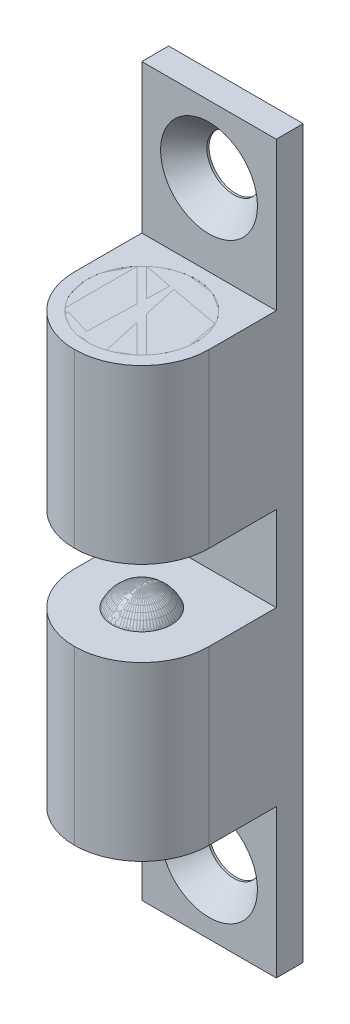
ISO-10303-21;
HEADER;
FILE_DESCRIPTION(('STEP AP214'),'2;1');
FILE_NAME('part.step','',(''),(''),'','','');
FILE_SCHEMA(('AUTOMOTIVE_DESIGN { 1 0 10303 214 1 1 1 1 }'));
ENDSEC;
DATA;
#1=APPLICATION_CONTEXT('core data for automotive mechanical design processes');
#2=APPLICATION_PROTOCOL_DEFINITION('international standard','automotive_design',2000,#1);
#3=PRODUCT_CONTEXT('',#1,'mechanical');
#4=PRODUCT('Part','Part','',(#3));
#5=PRODUCT_RELATED_PRODUCT_CATEGORY('part','',(#4));
#6=PRODUCT_DEFINITION_FORMATION('','',#4);
#7=PRODUCT_DEFINITION_CONTEXT('part definition',#1,'design');
#8=PRODUCT_DEFINITION('design','',#6,#7);
#9=PRODUCT_DEFINITION_SHAPE('','',#8);
#10=(LENGTH_UNIT() NAMED_UNIT(*) SI_UNIT(.MILLI.,.METRE.));
#11=(NAMED_UNIT(*) PLANE_ANGLE_UNIT() SI_UNIT($,.RADIAN.));
#12=(NAMED_UNIT(*) SI_UNIT($,.STERADIAN.) SOLID_ANGLE_UNIT());
#13=UNCERTAINTY_MEASURE_WITH_UNIT(LENGTH_MEASURE(1.E-05),#10,'distance_accuracy_value','');
#14=(GEOMETRIC_REPRESENTATION_CONTEXT(3) GLOBAL_UNCERTAINTY_ASSIGNED_CONTEXT((#13)) GLOBAL_UNIT_ASSIGNED_CONTEXT((#10,
#11,#12)) REPRESENTATION_CONTEXT('',''));
#15=CARTESIAN_POINT('',(0.,0.,0.));
#16=DIRECTION('',(0.,0.,1.));
#17=DIRECTION('',(1.,0.,0.));
#18=AXIS2_PLACEMENT_3D('',#15,#16,#17);
#19=CARTESIAN_POINT('',(0.,-3.27025,5.55625));
#20=DIRECTION('',(0.,0.,-1.));
#21=DIRECTION('',(0.,-1.,0.));
#22=AXIS2_PLACEMENT_3D('',#19,#20,#21);
#23=SPHERICAL_SURFACE('',#22,1.905);
#24=CARTESIAN_POINT('',(0.,-3.27025,5.55625));
#25=DIRECTION('',(0.,1.,0.));
#26=DIRECTION('',(0.,0.,1.));
#27=AXIS2_PLACEMENT_3D('',#24,#25,#26);
#28=SPHERICAL_SURFACE('',#27,1.905);
#29=CARTESIAN_POINT('',(0.,-2.50825,5.55625));
#30=DIRECTION('',(0.,1.,0.));
#31=DIRECTION('',(0.,0.,1.));
#32=AXIS2_PLACEMENT_3D('',#29,#30,#31);
#33=CIRCLE('',#32,1.74596133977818);
#34=CARTESIAN_POINT('',(0.,-2.50825,7.30221133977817));
#35=VERTEX_POINT('',#34);
#36=EDGE_CURVE('E11',#35,#35,#33,.F.);
#37=ORIENTED_EDGE('',*,*,#36,.F.);
#38=EDGE_LOOP('',(#37));
#39=FACE_BOUND('',#38,.T.);
#40=ADVANCED_FACE('F45',(#39),#28,.T.);
#41=CARTESIAN_POINT('',(3.96875,-2.50825,1.5875));
#42=DIRECTION('',(0.,-1.,0.));
#43=DIRECTION('',(0.,0.,1.));
#44=AXIS2_PLACEMENT_3D('',#41,#42,#43);
#45=PLANE('',#44);
#46=ORIENTED_EDGE('',*,*,#36,.T.);
#47=EDGE_LOOP('',(#46));
#48=FACE_BOUND('',#47,.T.);
#49=ADVANCED_FACE('F52',(#48),#45,.T.);
#50=CLOSED_SHELL('',(#40,#49));
#51=MANIFOLD_SOLID_BREP('B2',#50);
#52=CARTESIAN_POINT('',(0.,12.66825,2.34665636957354));
#53=DIRECTION('',(0.,1.,0.));
#54=DIRECTION('',(0.,0.,-1.));
#55=AXIS2_PLACEMENT_3D('',#52,#53,#54);
#56=PLANE('',#55);
#57=CARTESIAN_POINT('',(0.,12.66825,5.55625));
#58=DIRECTION('',(0.,-1.,0.));
#59=DIRECTION('',(0.,0.,-1.));
#60=AXIS2_PLACEMENT_3D('',#57,#58,#59);
#61=CIRCLE('',#60,3.20959363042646);
#62=CARTESIAN_POINT('',(-2.13082049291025,12.66825,3.15602182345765));
#63=VERTEX_POINT('',#62);
#64=CARTESIAN_POINT('',(2.40022817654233,12.66825,7.68707049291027));
#65=VERTEX_POINT('',#64);
#66=EDGE_CURVE('E151',#63,#65,#61,.T.);
#67=ORIENTED_EDGE('',*,*,#66,.F.);
#68=DIRECTION('',(-0.707106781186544,0.,-0.707106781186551));
#69=VECTOR('',#68,1.);
#70=CARTESIAN_POINT('',(-1.47009297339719,12.66825,3.81674934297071));
#71=LINE('',#70,#69);
#72=EDGE_CURVE('E88',#65,#63,#71,.T.);
#73=ORIENTED_EDGE('',*,*,#72,.F.);
#74=EDGE_LOOP('',(#67,#73));
#75=FACE_BOUND('',#74,.T.);
#76=ADVANCED_FACE('F80',(#75),#56,.T.);
#77=CARTESIAN_POINT('',(0.,12.03325,3.81028866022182));
#78=DIRECTION('',(0.,-1.,0.));
#79=DIRECTION('',(0.,0.,1.));
#80=AXIS2_PLACEMENT_3D('',#77,#78,#79);
#81=PLANE('',#80);
#82=CARTESIAN_POINT('',(0.,12.03325,5.55625));
#83=DIRECTION('',(0.,-1.,0.));
#84=DIRECTION('',(0.,0.,-1.));
#85=AXIS2_PLACEMENT_3D('',#82,#83,#84);
#86=CIRCLE('',#85,1.74596133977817);
#87=CARTESIAN_POINT('',(0.,12.03325,3.81028866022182));
#88=VERTEX_POINT('',#87);
#89=EDGE_CURVE('E140',#88,#88,#86,.T.);
#90=ORIENTED_EDGE('',*,*,#89,.F.);
#91=EDGE_LOOP('',(#90));
#92=FACE_BOUND('',#91,.T.);
#93=CARTESIAN_POINT('',(0.,12.03325,5.55625));
#94=DIRECTION('',(0.,-1.,0.));
#95=DIRECTION('',(0.,0.,-1.));
#96=AXIS2_PLACEMENT_3D('',#93,#94,#95);
#97=CIRCLE('',#96,3.20959363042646);
#98=CARTESIAN_POINT('',(0.,12.03325,2.34665636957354));
#99=VERTEX_POINT('',#98);
#100=EDGE_CURVE('E153',#99,#99,#97,.T.);
#101=ORIENTED_EDGE('',*,*,#100,.T.);
#102=EDGE_LOOP('',(#101));
#103=FACE_BOUND('',#102,.T.);
#104=ADVANCED_FACE('F82',(#92,#103),#81,.T.);
#105=CARTESIAN_POINT('',(0.,12.66825,5.55625));
#106=DIRECTION('',(0.,1.,0.));
#107=DIRECTION('',(0.,0.,-1.));
#108=AXIS2_PLACEMENT_3D('',#105,#106,#107);
#109=CYLINDRICAL_SURFACE('',#108,3.20959363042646);
#110=DIRECTION('',(0.,-1.,0.));
#111=VECTOR('',#110,1.);
#112=CARTESIAN_POINT('',(-2.40022817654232,21.43125,3.42542950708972));
#113=LINE('',#112,#111);
#114=CARTESIAN_POINT('',(-2.40022817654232,12.66825,3.42542950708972));
#115=VERTEX_POINT('',#114);
#116=CARTESIAN_POINT('',(-2.40022817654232,12.64285,3.42542950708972));
#117=VERTEX_POINT('',#116);
#118=EDGE_CURVE('E125',#115,#117,#113,.T.);
#119=ORIENTED_EDGE('',*,*,#118,.T.);
#120=CARTESIAN_POINT('',(0.,12.64285,5.55625));
#121=DIRECTION('',(0.,-1.,0.));
#122=DIRECTION('',(0.,0.,-1.));
#123=AXIS2_PLACEMENT_3D('',#120,#121,#122);
#124=CIRCLE('',#123,3.20959363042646);
#125=CARTESIAN_POINT('',(-2.13082049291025,12.64285,3.15602182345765));
#126=VERTEX_POINT('',#125);
#127=EDGE_CURVE('E131',#117,#126,#124,.T.);
#128=ORIENTED_EDGE('',*,*,#127,.T.);
#129=DIRECTION('',(0.,-1.,0.));
#130=VECTOR('',#129,1.);
#131=CARTESIAN_POINT('',(-2.13082049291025,21.43125,3.15602182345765));
#132=LINE('',#131,#130);
#133=EDGE_CURVE('E95',#63,#126,#132,.T.);
#134=ORIENTED_EDGE('',*,*,#133,.F.);
#135=ORIENTED_EDGE('',*,*,#66,.T.);
#136=DIRECTION('',(0.,-1.,0.));
#137=VECTOR('',#136,1.);
#138=CARTESIAN_POINT('',(2.40022817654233,21.43125,7.68707049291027));
#139=LINE('',#138,#137);
#140=CARTESIAN_POINT('',(2.40022817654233,12.64285,7.68707049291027));
#141=VERTEX_POINT('',#140);
#142=EDGE_CURVE('E145',#65,#141,#139,.T.);
#143=ORIENTED_EDGE('',*,*,#142,.T.);
#144=CARTESIAN_POINT('',(2.13082049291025,12.64285,7.95647817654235));
#145=VERTEX_POINT('',#144);
#146=EDGE_CURVE('E136',#141,#145,#124,.T.);
#147=ORIENTED_EDGE('',*,*,#146,.T.);
#148=DIRECTION('',(0.,-1.,0.));
#149=VECTOR('',#148,1.);
#150=CARTESIAN_POINT('',(2.13082049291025,21.43125,7.95647817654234));
#151=LINE('',#150,#149);
#152=CARTESIAN_POINT('',(2.13082049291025,12.66825,7.95647817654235));
#153=VERTEX_POINT('',#152);
#154=EDGE_CURVE('E127',#153,#145,#151,.T.);
#155=ORIENTED_EDGE('',*,*,#154,.F.);
#156=EDGE_CURVE('E139',#153,#115,#61,.T.);
#157=ORIENTED_EDGE('',*,*,#156,.T.);
#158=EDGE_LOOP('',(#119,#128,#134,#135,#143,#147,#155,#157));
#159=FACE_BOUND('',#158,.T.);
#160=ORIENTED_EDGE('',*,*,#100,.F.);
#161=EDGE_LOOP('',(#160));
#162=FACE_BOUND('',#161,.T.);
#163=ADVANCED_FACE('F137',(#159,#162),#109,.T.);
#164=DIRECTION('',(-0.707106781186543,0.,-0.707106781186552));
#165=VECTOR('',#164,1.);
#166=CARTESIAN_POINT('',(-1.73950065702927,12.66825,4.08615702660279));
#167=LINE('',#166,#165);
#168=EDGE_CURVE('E43',#153,#115,#167,.T.);
#169=ORIENTED_EDGE('',*,*,#168,.T.);
#170=ORIENTED_EDGE('',*,*,#156,.F.);
#171=EDGE_LOOP('',(#169,#170));
#172=FACE_BOUND('',#171,.T.);
#173=ADVANCED_FACE('F165',(#172),#56,.T.);
#174=CARTESIAN_POINT('',(0.,2.50825,5.55625));
#175=DIRECTION('',(0.,-1.,0.));
#176=DIRECTION('',(0.,0.,1.));
#177=AXIS2_PLACEMENT_3D('',#174,#175,#176);
#178=PLANE('',#177);
#179=CARTESIAN_POINT('',(0.,2.50825,5.55625));
#180=DIRECTION('',(0.,-1.,0.));
#181=DIRECTION('',(0.,0.,-1.));
#182=AXIS2_PLACEMENT_3D('',#179,#180,#181);
#183=CIRCLE('',#182,1.74596133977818);
#184=CARTESIAN_POINT('',(0.,2.50825,3.81028866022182));
#185=VERTEX_POINT('',#184);
#186=EDGE_CURVE('E143',#185,#185,#183,.T.);
#187=ORIENTED_EDGE('',*,*,#186,.T.);
#188=EDGE_LOOP('',(#187));
#189=FACE_BOUND('',#188,.T.);
#190=ADVANCED_FACE('F172',(#189),#178,.T.);
#191=CARTESIAN_POINT('',(0.,12.66825,5.55625));
#192=DIRECTION('',(0.,1.,0.));
#193=DIRECTION('',(0.,0.,-1.));
#194=AXIS2_PLACEMENT_3D('',#191,#192,#193);
#195=CYLINDRICAL_SURFACE('',#194,1.74596133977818);
#196=ORIENTED_EDGE('',*,*,#186,.F.);
#197=EDGE_LOOP('',(#196));
#198=FACE_BOUND('',#197,.T.);
#199=ORIENTED_EDGE('',*,*,#89,.T.);
#200=EDGE_LOOP('',(#199));
#201=FACE_BOUND('',#200,.T.);
#202=ADVANCED_FACE('F177',(#198,#201),#195,.T.);
#203=CARTESIAN_POINT('',(-2.91282884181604,21.43125,2.912828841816));
#204=DIRECTION('',(-0.707106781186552,0.,0.707106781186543));
#205=DIRECTION('',(0.707106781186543,0.,0.707106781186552));
#206=AXIS2_PLACEMENT_3D('',#203,#204,#205);
#207=PLANE('',#206);
#208=ORIENTED_EDGE('',*,*,#168,.F.);
#209=ORIENTED_EDGE('',*,*,#154,.T.);
#210=DIRECTION('',(0.707106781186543,0.,0.707106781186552));
#211=VECTOR('',#210,1.);
#212=CARTESIAN_POINT('',(-2.91282884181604,12.64285,2.912828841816));
#213=LINE('',#212,#211);
#214=EDGE_CURVE('E121',#117,#145,#213,.T.);
#215=ORIENTED_EDGE('',*,*,#214,.F.);
#216=ORIENTED_EDGE('',*,*,#118,.F.);
#217=EDGE_LOOP('',(#208,#209,#215,#216));
#218=FACE_BOUND('',#217,.T.);
#219=ADVANCED_FACE('F123',(#218),#207,.F.);
#220=CARTESIAN_POINT('',(-2.64342115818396,21.43125,2.64342115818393));
#221=DIRECTION('',(-0.707106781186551,0.,0.707106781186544));
#222=DIRECTION('',(0.707106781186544,0.,0.707106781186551));
#223=AXIS2_PLACEMENT_3D('',#220,#221,#222);
#224=PLANE('',#223);
#225=ORIENTED_EDGE('',*,*,#142,.F.);
#226=ORIENTED_EDGE('',*,*,#72,.T.);
#227=ORIENTED_EDGE('',*,*,#133,.T.);
#228=DIRECTION('',(0.707106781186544,0.,0.707106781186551));
#229=VECTOR('',#228,1.);
#230=CARTESIAN_POINT('',(-2.64342115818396,12.64285,2.64342115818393));
#231=LINE('',#230,#229);
#232=EDGE_CURVE('E134',#126,#141,#231,.T.);
#233=ORIENTED_EDGE('',*,*,#232,.T.);
#234=EDGE_LOOP('',(#225,#226,#227,#233));
#235=FACE_BOUND('',#234,.T.);
#236=ADVANCED_FACE('F158',(#235),#224,.T.);
#237=CARTESIAN_POINT('',(0.,12.64285,0.));
#238=DIRECTION('',(0.,1.,0.));
#239=DIRECTION('',(0.,0.,-1.));
#240=AXIS2_PLACEMENT_3D('',#237,#238,#239);
#241=PLANE('',#240);
#242=ORIENTED_EDGE('',*,*,#214,.T.);
#243=ORIENTED_EDGE('',*,*,#146,.F.);
#244=ORIENTED_EDGE('',*,*,#232,.F.);
#245=ORIENTED_EDGE('',*,*,#127,.F.);
#246=EDGE_LOOP('',(#242,#243,#244,#245));
#247=FACE_BOUND('',#246,.T.);
#248=ADVANCED_FACE('F133',(#247),#241,.T.);
#249=CLOSED_SHELL('',(#76,#104,#163,#173,#190,#202,#219,#236,#248));
#250=MANIFOLD_SOLID_BREP('B6',#249);
#251=CARTESIAN_POINT('',(0.,-12.66825,2.34665636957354));
#252=DIRECTION('',(0.,-1.,0.));
#253=DIRECTION('',(0.,0.,-1.));
#254=AXIS2_PLACEMENT_3D('',#251,#252,#253);
#255=PLANE('',#254);
#256=CARTESIAN_POINT('',(0.,-12.66825,5.55625));
#257=DIRECTION('',(0.,-1.,0.));
#258=DIRECTION('',(0.,0.,-1.));
#259=AXIS2_PLACEMENT_3D('',#256,#257,#258);
#260=CIRCLE('',#259,3.20959363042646);
#261=CARTESIAN_POINT('',(-2.13082049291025,-12.66825,3.15602182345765));
#262=VERTEX_POINT('',#261);
#263=CARTESIAN_POINT('',(2.40022817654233,-12.66825,7.68707049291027));
#264=VERTEX_POINT('',#263);
#265=EDGE_CURVE('E326',#262,#264,#260,.T.);
#266=ORIENTED_EDGE('',*,*,#265,.T.);
#267=DIRECTION('',(-0.707106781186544,0.,-0.707106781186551));
#268=VECTOR('',#267,1.);
#269=CARTESIAN_POINT('',(-1.47009297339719,-12.66825,3.81674934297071));
#270=LINE('',#269,#268);
#271=EDGE_CURVE('E261',#264,#262,#270,.T.);
#272=ORIENTED_EDGE('',*,*,#271,.T.);
#273=EDGE_LOOP('',(#266,#272));
#274=FACE_BOUND('',#273,.T.);
#275=ADVANCED_FACE('F253',(#274),#255,.T.);
#276=CARTESIAN_POINT('',(0.,-12.03325,3.81028866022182));
#277=DIRECTION('',(0.,1.,0.));
#278=DIRECTION('',(0.,0.,1.));
#279=AXIS2_PLACEMENT_3D('',#276,#277,#278);
#280=PLANE('',#279);
#281=CARTESIAN_POINT('',(0.,-12.03325,5.55625));
#282=DIRECTION('',(0.,-1.,0.));
#283=DIRECTION('',(0.,0.,-1.));
#284=AXIS2_PLACEMENT_3D('',#281,#282,#283);
#285=CIRCLE('',#284,1.74596133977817);
#286=CARTESIAN_POINT('',(0.,-12.03325,3.81028866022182));
#287=VERTEX_POINT('',#286);
#288=EDGE_CURVE('E298',#287,#287,#285,.T.);
#289=ORIENTED_EDGE('',*,*,#288,.T.);
#290=EDGE_LOOP('',(#289));
#291=FACE_BOUND('',#290,.T.);
#292=CARTESIAN_POINT('',(0.,-12.03325,5.55625));
#293=DIRECTION('',(0.,-1.,0.));
#294=DIRECTION('',(0.,0.,-1.));
#295=AXIS2_PLACEMENT_3D('',#292,#293,#294);
#296=CIRCLE('',#295,3.20959363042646);
#297=CARTESIAN_POINT('',(0.,-12.03325,2.34665636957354));
#298=VERTEX_POINT('',#297);
#299=EDGE_CURVE('E330',#298,#298,#296,.T.);
#300=ORIENTED_EDGE('',*,*,#299,.F.);
#301=EDGE_LOOP('',(#300));
#302=FACE_BOUND('',#301,.T.);
#303=ADVANCED_FACE('F255',(#291,#302),#280,.T.);
#304=CARTESIAN_POINT('',(0.,-12.66825,5.55625));
#305=DIRECTION('',(0.,-1.,0.));
#306=DIRECTION('',(0.,0.,-1.));
#307=AXIS2_PLACEMENT_3D('',#304,#305,#306);
#308=CYLINDRICAL_SURFACE('',#307,3.20959363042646);
#309=DIRECTION('',(0.,1.,0.));
#310=VECTOR('',#309,1.);
#311=CARTESIAN_POINT('',(-2.40022817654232,-21.43125,3.42542950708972));
#312=LINE('',#311,#310);
#313=CARTESIAN_POINT('',(-2.40022817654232,-12.66825,3.42542950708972));
#314=VERTEX_POINT('',#313);
#315=CARTESIAN_POINT('',(-2.40022817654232,-12.64285,3.42542950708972));
#316=VERTEX_POINT('',#315);
#317=EDGE_CURVE('E289',#314,#316,#312,.T.);
#318=ORIENTED_EDGE('',*,*,#317,.F.);
#319=CARTESIAN_POINT('',(2.13082049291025,-12.66825,7.95647817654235));
#320=VERTEX_POINT('',#319);
#321=EDGE_CURVE('E329',#320,#314,#260,.T.);
#322=ORIENTED_EDGE('',*,*,#321,.F.);
#323=DIRECTION('',(0.,1.,0.));
#324=VECTOR('',#323,1.);
#325=CARTESIAN_POINT('',(2.13082049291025,-21.43125,7.95647817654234));
#326=LINE('',#325,#324);
#327=CARTESIAN_POINT('',(2.13082049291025,-12.64285,7.95647817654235));
#328=VERTEX_POINT('',#327);
#329=EDGE_CURVE('E315',#320,#328,#326,.T.);
#330=ORIENTED_EDGE('',*,*,#329,.T.);
#331=CARTESIAN_POINT('',(0.,-12.64285,5.55625));
#332=DIRECTION('',(0.,-1.,0.));
#333=DIRECTION('',(0.,0.,-1.));
#334=AXIS2_PLACEMENT_3D('',#331,#332,#333);
#335=CIRCLE('',#334,3.20959363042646);
#336=CARTESIAN_POINT('',(2.40022817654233,-12.64285,7.68707049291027));
#337=VERTEX_POINT('',#336);
#338=EDGE_CURVE('E306',#337,#328,#335,.T.);
#339=ORIENTED_EDGE('',*,*,#338,.F.);
#340=DIRECTION('',(0.,1.,0.));
#341=VECTOR('',#340,1.);
#342=CARTESIAN_POINT('',(2.40022817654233,-21.43125,7.68707049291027));
#343=LINE('',#342,#341);
#344=EDGE_CURVE('E316',#264,#337,#343,.T.);
#345=ORIENTED_EDGE('',*,*,#344,.F.);
#346=ORIENTED_EDGE('',*,*,#265,.F.);
#347=DIRECTION('',(0.,1.,0.));
#348=VECTOR('',#347,1.);
#349=CARTESIAN_POINT('',(-2.13082049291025,-21.43125,3.15602182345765));
#350=LINE('',#349,#348);
#351=CARTESIAN_POINT('',(-2.13082049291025,-12.64285,3.15602182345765));
#352=VERTEX_POINT('',#351);
#353=EDGE_CURVE('E268',#262,#352,#350,.T.);
#354=ORIENTED_EDGE('',*,*,#353,.T.);
#355=EDGE_CURVE('E304',#316,#352,#335,.T.);
#356=ORIENTED_EDGE('',*,*,#355,.F.);
#357=EDGE_LOOP('',(#318,#322,#330,#339,#345,#346,#354,#356));
#358=FACE_BOUND('',#357,.T.);
#359=ORIENTED_EDGE('',*,*,#299,.T.);
#360=EDGE_LOOP('',(#359));
#361=FACE_BOUND('',#360,.T.);
#362=ADVANCED_FACE('F309',(#358,#361),#308,.T.);
#363=DIRECTION('',(-0.707106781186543,0.,-0.707106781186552));
#364=VECTOR('',#363,1.);
#365=CARTESIAN_POINT('',(-1.73950065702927,-12.66825,4.08615702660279));
#366=LINE('',#365,#364);
#367=EDGE_CURVE('E78',#320,#314,#366,.T.);
#368=ORIENTED_EDGE('',*,*,#367,.F.);
#369=ORIENTED_EDGE('',*,*,#321,.T.);
#370=EDGE_LOOP('',(#368,#369));
#371=FACE_BOUND('',#370,.T.);
#372=ADVANCED_FACE('F346',(#371),#255,.T.);
#373=CARTESIAN_POINT('',(0.,-2.50825,5.55625));
#374=DIRECTION('',(0.,1.,0.));
#375=DIRECTION('',(0.,0.,1.));
#376=AXIS2_PLACEMENT_3D('',#373,#374,#375);
#377=PLANE('',#376);
#378=CARTESIAN_POINT('',(0.,-2.50825,5.55625));
#379=DIRECTION('',(0.,-1.,0.));
#380=DIRECTION('',(0.,0.,-1.));
#381=AXIS2_PLACEMENT_3D('',#378,#379,#380);
#382=CIRCLE('',#381,1.74596133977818);
#383=CARTESIAN_POINT('',(0.,-2.50825,3.81028866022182));
#384=VERTEX_POINT('',#383);
#385=EDGE_CURVE('E323',#384,#384,#382,.T.);
#386=ORIENTED_EDGE('',*,*,#385,.F.);
#387=EDGE_LOOP('',(#386));
#388=FACE_BOUND('',#387,.T.);
#389=ADVANCED_FACE('F353',(#388),#377,.T.);
#390=CARTESIAN_POINT('',(0.,-12.66825,5.55625));
#391=DIRECTION('',(0.,-1.,0.));
#392=DIRECTION('',(0.,0.,-1.));
#393=AXIS2_PLACEMENT_3D('',#390,#391,#392);
#394=CYLINDRICAL_SURFACE('',#393,1.74596133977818);
#395=ORIENTED_EDGE('',*,*,#385,.T.);
#396=EDGE_LOOP('',(#395));
#397=FACE_BOUND('',#396,.T.);
#398=ORIENTED_EDGE('',*,*,#288,.F.);
#399=EDGE_LOOP('',(#398));
#400=FACE_BOUND('',#399,.T.);
#401=ADVANCED_FACE('F342',(#397,#400),#394,.T.);
#402=CARTESIAN_POINT('',(-2.91282884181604,-21.43125,2.912828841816));
#403=DIRECTION('',(-0.707106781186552,0.,0.707106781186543));
#404=DIRECTION('',(0.707106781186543,0.,0.707106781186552));
#405=AXIS2_PLACEMENT_3D('',#402,#403,#404);
#406=PLANE('',#405);
#407=ORIENTED_EDGE('',*,*,#367,.T.);
#408=ORIENTED_EDGE('',*,*,#317,.T.);
#409=DIRECTION('',(0.707106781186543,0.,0.707106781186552));
#410=VECTOR('',#409,1.);
#411=CARTESIAN_POINT('',(-2.91282884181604,-12.64285,2.912828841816));
#412=LINE('',#411,#410);
#413=EDGE_CURVE('E292',#316,#328,#412,.T.);
#414=ORIENTED_EDGE('',*,*,#413,.T.);
#415=ORIENTED_EDGE('',*,*,#329,.F.);
#416=EDGE_LOOP('',(#407,#408,#414,#415));
#417=FACE_BOUND('',#416,.T.);
#418=ADVANCED_FACE('F291',(#417),#406,.F.);
#419=CARTESIAN_POINT('',(-2.64342115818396,-21.43125,2.64342115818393));
#420=DIRECTION('',(-0.707106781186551,0.,0.707106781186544));
#421=DIRECTION('',(0.707106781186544,0.,0.707106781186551));
#422=AXIS2_PLACEMENT_3D('',#419,#420,#421);
#423=PLANE('',#422);
#424=ORIENTED_EDGE('',*,*,#344,.T.);
#425=DIRECTION('',(0.707106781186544,0.,0.707106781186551));
#426=VECTOR('',#425,1.);
#427=CARTESIAN_POINT('',(-2.64342115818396,-12.64285,2.64342115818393));
#428=LINE('',#427,#426);
#429=EDGE_CURVE('E312',#352,#337,#428,.T.);
#430=ORIENTED_EDGE('',*,*,#429,.F.);
#431=ORIENTED_EDGE('',*,*,#353,.F.);
#432=ORIENTED_EDGE('',*,*,#271,.F.);
#433=EDGE_LOOP('',(#424,#430,#431,#432));
#434=FACE_BOUND('',#433,.T.);
#435=ADVANCED_FACE('F334',(#434),#423,.T.);
#436=CARTESIAN_POINT('',(0.,-12.64285,0.));
#437=DIRECTION('',(0.,-1.,0.));
#438=DIRECTION('',(0.,0.,-1.));
#439=AXIS2_PLACEMENT_3D('',#436,#437,#438);
#440=PLANE('',#439);
#441=ORIENTED_EDGE('',*,*,#413,.F.);
#442=ORIENTED_EDGE('',*,*,#355,.T.);
#443=ORIENTED_EDGE('',*,*,#429,.T.);
#444=ORIENTED_EDGE('',*,*,#338,.T.);
#445=EDGE_LOOP('',(#441,#442,#443,#444));
#446=FACE_BOUND('',#445,.T.);
#447=ADVANCED_FACE('F302',(#446),#440,.T.);
#448=CLOSED_SHELL('',(#275,#303,#362,#372,#389,#401,#418,#435,#447));
#449=MANIFOLD_SOLID_BREP('B37',#448);
#450=CARTESIAN_POINT('',(0.,12.03325,3.81028866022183));
#451=DIRECTION('',(0.,-1.,0.));
#452=DIRECTION('',(0.,0.,-1.));
#453=AXIS2_PLACEMENT_3D('',#450,#451,#452);
#454=PLANE('',#453);
#455=CARTESIAN_POINT('',(0.,12.03325,5.55625000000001));
#456=DIRECTION('',(0.,-1.,0.));
#457=DIRECTION('',(0.,0.,-1.));
#458=AXIS2_PLACEMENT_3D('',#455,#456,#457);
#459=CIRCLE('',#458,3.20959363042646);
#460=CARTESIAN_POINT('',(0.,12.03325,2.34665636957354));
#461=VERTEX_POINT('',#460);
#462=EDGE_CURVE('E252',#461,#461,#459,.T.);
#463=ORIENTED_EDGE('',*,*,#462,.T.);
#464=EDGE_LOOP('',(#463));
#465=FACE_BOUND('',#464,.T.);
#466=CARTESIAN_POINT('',(0.,12.03325,5.55625000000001));
#467=DIRECTION('',(0.,-1.,0.));
#468=DIRECTION('',(0.,0.,-1.));
#469=AXIS2_PLACEMENT_3D('',#466,#467,#468);
#470=CIRCLE('',#469,1.74596133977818);
#471=CARTESIAN_POINT('',(0.,12.03325,3.81028866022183));
#472=VERTEX_POINT('',#471);
#473=EDGE_CURVE('E442',#472,#472,#470,.T.);
#474=ORIENTED_EDGE('',*,*,#473,.F.);
#475=EDGE_LOOP('',(#474));
#476=FACE_BOUND('',#475,.T.);
#477=ADVANCED_FACE('F428',(#465,#476),#454,.T.);
#478=CARTESIAN_POINT('',(0.,-12.66825,5.55625));
#479=DIRECTION('',(0.,-1.,0.));
#480=DIRECTION('',(0.,0.,-1.));
#481=AXIS2_PLACEMENT_3D('',#478,#479,#480);
#482=CYLINDRICAL_SURFACE('',#481,3.20959363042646);
#483=CARTESIAN_POINT('',(0.,12.66825,5.55625000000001));
#484=DIRECTION('',(0.,-1.,0.));
#485=DIRECTION('',(0.,0.,-1.));
#486=AXIS2_PLACEMENT_3D('',#483,#484,#485);
#487=CIRCLE('',#486,3.20959363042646);
#488=CARTESIAN_POINT('',(0.,12.66825,2.34665636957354));
#489=VERTEX_POINT('',#488);
#490=EDGE_CURVE('E434',#489,#489,#487,.T.);
#491=ORIENTED_EDGE('',*,*,#490,.T.);
#492=EDGE_LOOP('',(#491));
#493=FACE_BOUND('',#492,.T.);
#494=ORIENTED_EDGE('',*,*,#462,.F.);
#495=EDGE_LOOP('',(#494));
#496=FACE_BOUND('',#495,.T.);
#497=ADVANCED_FACE('F452',(#493,#496),#482,.T.);
#498=CARTESIAN_POINT('',(0.,12.66825,2.34665636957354));
#499=DIRECTION('',(0.,1.,0.));
#500=DIRECTION('',(0.,0.,1.));
#501=AXIS2_PLACEMENT_3D('',#498,#499,#500);
#502=PLANE('',#501);
#503=ORIENTED_EDGE('',*,*,#490,.F.);
#504=EDGE_LOOP('',(#503));
#505=FACE_BOUND('',#504,.T.);
#506=ADVANCED_FACE('F456',(#505),#502,.T.);
#507=CARTESIAN_POINT('',(0.,2.50825,5.55625));
#508=DIRECTION('',(0.,-1.,0.));
#509=DIRECTION('',(0.,0.,-1.));
#510=AXIS2_PLACEMENT_3D('',#507,#508,#509);
#511=PLANE('',#510);
#512=CARTESIAN_POINT('',(0.,2.50825,5.55625));
#513=DIRECTION('',(0.,-1.,0.));
#514=DIRECTION('',(0.,0.,-1.));
#515=AXIS2_PLACEMENT_3D('',#512,#513,#514);
#516=CIRCLE('',#515,1.74596133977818);
#517=CARTESIAN_POINT('',(0.,2.50825,3.81028866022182));
#518=VERTEX_POINT('',#517);
#519=EDGE_CURVE('E438',#518,#518,#516,.T.);
#520=ORIENTED_EDGE('',*,*,#519,.T.);
#521=EDGE_LOOP('',(#520));
#522=FACE_BOUND('',#521,.T.);
#523=ADVANCED_FACE('F460',(#522),#511,.T.);
#524=CARTESIAN_POINT('',(0.,-12.66825,5.55625));
#525=DIRECTION('',(0.,-1.,0.));
#526=DIRECTION('',(0.,0.,-1.));
#527=AXIS2_PLACEMENT_3D('',#524,#525,#526);
#528=CYLINDRICAL_SURFACE('',#527,1.74596133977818);
#529=ORIENTED_EDGE('',*,*,#473,.T.);
#530=EDGE_LOOP('',(#529));
#531=FACE_BOUND('',#530,.T.);
#532=ORIENTED_EDGE('',*,*,#519,.F.);
#533=EDGE_LOOP('',(#532));
#534=FACE_BOUND('',#533,.T.);
#535=ADVANCED_FACE('F448',(#531,#534),#528,.T.);
#536=CLOSED_SHELL('',(#477,#497,#506,#523,#535));
#537=MANIFOLD_SOLID_BREP('B72_NOT_SHOWN',#536);
#538=CARTESIAN_POINT('',(0.,2.43007441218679,5.55625));
#539=DIRECTION('',(0.,-1.,0.));
#540=DIRECTION('',(0.,0.,-1.));
#541=AXIS2_PLACEMENT_3D('',#538,#539,#540);
#542=CYLINDRICAL_SURFACE('',#541,1.74596133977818);
#543=CARTESIAN_POINT('',(0.,-2.50825,5.55625));
#544=DIRECTION('',(0.,-1.,0.));
#545=DIRECTION('',(0.,0.,-1.));
#546=AXIS2_PLACEMENT_3D('',#543,#544,#545);
#547=CIRCLE('',#546,1.74596133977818);
#548=CARTESIAN_POINT('',(0.,-2.50825,3.81028866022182));
#549=VERTEX_POINT('',#548);
#550=EDGE_CURVE('E516',#549,#549,#547,.F.);
#551=ORIENTED_EDGE('',*,*,#550,.T.);
#552=EDGE_LOOP('',(#551));
#553=FACE_BOUND('',#552,.T.);
#554=CARTESIAN_POINT('',(0.,-12.03325,5.55625));
#555=DIRECTION('',(0.,-1.,0.));
#556=DIRECTION('',(0.,0.,-1.));
#557=AXIS2_PLACEMENT_3D('',#554,#555,#556);
#558=CIRCLE('',#557,1.74596133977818);
#559=CARTESIAN_POINT('',(0.,-12.03325,3.81028866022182));
#560=VERTEX_POINT('',#559);
#561=EDGE_CURVE('E510',#560,#560,#558,.F.);
#562=ORIENTED_EDGE('',*,*,#561,.F.);
#563=EDGE_LOOP('',(#562));
#564=FACE_BOUND('',#563,.T.);
#565=ADVANCED_FACE('F506',(#553,#564),#542,.F.);
#566=CARTESIAN_POINT('',(0.,-2.43007441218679,5.55625));
#567=DIRECTION('',(0.,1.,0.));
#568=DIRECTION('',(0.,0.,1.));
#569=AXIS2_PLACEMENT_3D('',#566,#567,#568);
#570=CYLINDRICAL_SURFACE('',#569,1.74596133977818);
#571=CARTESIAN_POINT('',(0.,2.50825,5.55625));
#572=DIRECTION('',(0.,1.,0.));
#573=DIRECTION('',(0.,0.,1.));
#574=AXIS2_PLACEMENT_3D('',#571,#572,#573);
#575=CIRCLE('',#574,1.74596133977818);
#576=CARTESIAN_POINT('',(0.,2.50825,7.30221133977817));
#577=VERTEX_POINT('',#576);
#578=EDGE_CURVE('E426',#577,#577,#575,.F.);
#579=CARTESIAN_POINT('',(0.,12.03325,5.55625));
#580=DIRECTION('',(0.,1.,0.));
#581=DIRECTION('',(0.,0.,1.));
#582=AXIS2_PLACEMENT_3D('',#579,#580,#581);
#583=CIRCLE('',#582,1.74596133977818);
#584=CARTESIAN_POINT('',(0.,12.03325,7.30221133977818));
#585=VERTEX_POINT('',#584);
#586=EDGE_CURVE('E658',#585,#585,#583,.F.);
#587=CARTESIAN_POINT('',(0.,2.50825,7.30221133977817));
#588=CARTESIAN_POINT('',(0.,2.60746875,7.30221133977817));
#589=CARTESIAN_POINT('',(0.,2.7066875,7.30221133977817));
#590=CARTESIAN_POINT('',(0.,2.905125,7.30221133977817));
#591=CARTESIAN_POINT('',(0.,3.00434375,7.30221133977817));
#592=CARTESIAN_POINT('',(0.,3.20278125,7.30221133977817));
#593=CARTESIAN_POINT('',(0.,3.302,7.30221133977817));
#594=CARTESIAN_POINT('',(0.,3.5004375,7.30221133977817));
#595=CARTESIAN_POINT('',(0.,3.59965625,7.30221133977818));
#596=CARTESIAN_POINT('',(0.,3.79809375,7.30221133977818));
#597=CARTESIAN_POINT('',(0.,3.8973125,7.30221133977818));
#598=CARTESIAN_POINT('',(0.,4.09575,7.30221133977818));
#599=CARTESIAN_POINT('',(0.,4.19496875,7.30221133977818));
#600=CARTESIAN_POINT('',(0.,4.39340625,7.30221133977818));
#601=CARTESIAN_POINT('',(0.,4.492625,7.30221133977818));
#602=CARTESIAN_POINT('',(0.,4.6910625,7.30221133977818));
#603=CARTESIAN_POINT('',(0.,4.79028125,7.30221133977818));
#604=CARTESIAN_POINT('',(0.,4.98871875,7.30221133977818));
#605=CARTESIAN_POINT('',(0.,5.0879375,7.30221133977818));
#606=CARTESIAN_POINT('',(0.,5.286375,7.30221133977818));
#607=CARTESIAN_POINT('',(0.,5.38559375,7.30221133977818));
#608=CARTESIAN_POINT('',(0.,5.58403125,7.30221133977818));
#609=CARTESIAN_POINT('',(0.,5.68325,7.30221133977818));
#610=CARTESIAN_POINT('',(0.,5.8816875,7.30221133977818));
#611=CARTESIAN_POINT('',(0.,5.98090625,7.30221133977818));
#612=CARTESIAN_POINT('',(0.,6.17934375,7.30221133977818));
#613=CARTESIAN_POINT('',(0.,6.2785625,7.30221133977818));
#614=CARTESIAN_POINT('',(0.,6.477,7.30221133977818));
#615=CARTESIAN_POINT('',(0.,6.57621875,7.30221133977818));
#616=CARTESIAN_POINT('',(0.,6.77465625,7.30221133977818));
#617=CARTESIAN_POINT('',(0.,6.873875,7.30221133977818));
#618=CARTESIAN_POINT('',(0.,7.0723125,7.30221133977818));
#619=CARTESIAN_POINT('',(0.,7.17153125,7.30221133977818));
#620=CARTESIAN_POINT('',(0.,7.36996875,7.30221133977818));
#621=CARTESIAN_POINT('',(0.,7.4691875,7.30221133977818));
#622=CARTESIAN_POINT('',(0.,7.667625,7.30221133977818));
#623=CARTESIAN_POINT('',(0.,7.76684375,7.30221133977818));
#624=CARTESIAN_POINT('',(0.,7.96528125,7.30221133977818));
#625=CARTESIAN_POINT('',(0.,8.0645,7.30221133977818));
#626=CARTESIAN_POINT('',(0.,8.2629375,7.30221133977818));
#627=CARTESIAN_POINT('',(0.,8.36215625,7.30221133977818));
#628=CARTESIAN_POINT('',(0.,8.56059375,7.30221133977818));
#629=CARTESIAN_POINT('',(0.,8.6598125,7.30221133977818));
#630=CARTESIAN_POINT('',(0.,8.85825,7.30221133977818));
#631=CARTESIAN_POINT('',(0.,8.95746875,7.30221133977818));
#632=CARTESIAN_POINT('',(0.,9.15590625,7.30221133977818));
#633=CARTESIAN_POINT('',(0.,9.255125,7.30221133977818));
#634=CARTESIAN_POINT('',(0.,9.4535625,7.30221133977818));
#635=CARTESIAN_POINT('',(0.,9.55278125,7.30221133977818));
#636=CARTESIAN_POINT('',(0.,9.75121875,7.30221133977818));
#637=CARTESIAN_POINT('',(0.,9.8504375,7.30221133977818));
#638=CARTESIAN_POINT('',(0.,10.048875,7.30221133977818));
#639=CARTESIAN_POINT('',(0.,10.14809375,7.30221133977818));
#640=CARTESIAN_POINT('',(0.,10.34653125,7.30221133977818));
#641=CARTESIAN_POINT('',(0.,10.44575,7.30221133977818));
#642=CARTESIAN_POINT('',(0.,10.6441875,7.30221133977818));
#643=CARTESIAN_POINT('',(0.,10.74340625,7.30221133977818));
#644=CARTESIAN_POINT('',(0.,10.94184375,7.30221133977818));
#645=CARTESIAN_POINT('',(0.,11.0410625,7.30221133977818));
#646=CARTESIAN_POINT('',(0.,11.2395,7.30221133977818));
#647=CARTESIAN_POINT('',(0.,11.33871875,7.30221133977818));
#648=CARTESIAN_POINT('',(0.,11.53715625,7.30221133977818));
#649=CARTESIAN_POINT('',(0.,11.636375,7.30221133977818));
#650=CARTESIAN_POINT('',(0.,11.8348125,7.30221133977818));
#651=CARTESIAN_POINT('',(0.,11.93403125,7.30221133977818));
#652=CARTESIAN_POINT('',(0.,12.03325,7.30221133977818));
#653=B_SPLINE_CURVE_WITH_KNOTS('',3,(#587,#588,#589,#590,#591,#592,#593,#594,#595,#596,#597,
#598,#599,#600,#601,#602,#603,#604,#605,#606,#607,#608,#609,#610,#611,#612,#613,#614,#615,#616,
#617,#618,#619,#620,#621,#622,#623,#624,#625,#626,#627,#628,#629,#630,#631,#632,#633,#634,#635,
#636,#637,#638,#639,#640,#641,#642,#643,#644,#645,#646,#647,#648,#649,#650,#651,#652),
.UNSPECIFIED.,.F.,.F.,(4,2,2,2,2,2,2,2,2,2,2,2,2,2,2,2,2,2,2,2,2,2,2,2,2,2,2,2,2,2,2,2,4),(0.,
0.29765625,0.5953125,0.89296875,1.190625,1.48828125,1.7859375,2.08359375,2.38125,2.67890625,
2.9765625,3.27421875,3.571875,3.86953125,4.1671875,4.46484375,4.7625,5.06015625,5.3578125,
5.65546875,5.953125,6.25078125,6.5484375,6.84609375,7.14375,7.44140625,7.7390625,8.03671875,
8.334375,8.63203125,8.9296875,9.22734375,9.525),.UNSPECIFIED.);
#654=EDGE_CURVE('BSEAM508',#577,#585,#653,.T.);
#655=ORIENTED_EDGE('',*,*,#578,.T.);
#656=ORIENTED_EDGE('',*,*,#586,.F.);
#657=ORIENTED_EDGE('',*,*,#654,.T.);
#658=ORIENTED_EDGE('',*,*,#654,.F.);
#659=EDGE_LOOP('',(#655,#657,#656,#658));
#660=FACE_BOUND('',#659,.T.);
#661=ADVANCED_FACE('F508',(#660),#570,.F.);
#662=CARTESIAN_POINT('',(3.96875,12.66825,1.5875));
#663=DIRECTION('',(0.,0.,-1.));
#664=DIRECTION('',(-1.,0.,0.));
#665=AXIS2_PLACEMENT_3D('',#662,#663,#664);
#666=PLANE('',#665);
#667=CARTESIAN_POINT('',(0.,17.4625,1.5875));
#668=DIRECTION('',(0.,0.,1.));
#669=DIRECTION('',(1.,0.,0.));
#670=AXIS2_PLACEMENT_3D('',#667,#668,#669);
#671=CIRCLE('',#670,2.8575);
#672=CARTESIAN_POINT('',(2.8575,17.4625,1.5875));
#673=VERTEX_POINT('',#672);
#674=EDGE_CURVE('E656',#673,#673,#671,.T.);
#675=ORIENTED_EDGE('',*,*,#674,.F.);
#676=EDGE_LOOP('',(#675));
#677=FACE_BOUND('',#676,.T.);
#678=DIRECTION('',(0.,-1.,0.));
#679=VECTOR('',#678,1.);
#680=CARTESIAN_POINT('',(-3.96875,12.66825,1.5875));
#681=LINE('',#680,#679);
#682=CARTESIAN_POINT('',(-3.96875,21.43125,1.5875));
#683=VERTEX_POINT('',#682);
#684=CARTESIAN_POINT('',(-3.96875,12.66825,1.5875));
#685=VERTEX_POINT('',#684);
#686=EDGE_CURVE('E660',#683,#685,#681,.T.);
#687=ORIENTED_EDGE('',*,*,#686,.T.);
#688=DIRECTION('',(-1.,0.,0.));
#689=VECTOR('',#688,1.);
#690=CARTESIAN_POINT('',(3.96875,12.66825,1.5875));
#691=LINE('',#690,#689);
#692=CARTESIAN_POINT('',(3.96875,12.66825,1.5875));
#693=VERTEX_POINT('',#692);
#694=EDGE_CURVE('E750',#693,#685,#691,.T.);
#695=ORIENTED_EDGE('',*,*,#694,.F.);
#696=DIRECTION('',(0.,-1.,0.));
#697=VECTOR('',#696,1.);
#698=CARTESIAN_POINT('',(3.96875,12.66825,1.5875));
#699=LINE('',#698,#697);
#700=CARTESIAN_POINT('',(3.96875,21.43125,1.5875));
#701=VERTEX_POINT('',#700);
#702=EDGE_CURVE('E698',#701,#693,#699,.T.);
#703=ORIENTED_EDGE('',*,*,#702,.F.);
#704=DIRECTION('',(-1.,0.,0.));
#705=VECTOR('',#704,1.);
#706=CARTESIAN_POINT('',(3.96875,21.43125,1.5875));
#707=LINE('',#706,#705);
#708=EDGE_CURVE('E665',#701,#683,#707,.T.);
#709=ORIENTED_EDGE('',*,*,#708,.T.);
#710=EDGE_LOOP('',(#687,#695,#703,#709));
#711=FACE_BOUND('',#710,.T.);
#712=ADVANCED_FACE('F810',(#677,#711),#666,.F.);
#713=CARTESIAN_POINT('',(3.96875,12.66825,1.5875));
#714=DIRECTION('',(0.,-1.,0.));
#715=DIRECTION('',(0.,0.,-1.));
#716=AXIS2_PLACEMENT_3D('',#713,#714,#715);
#717=PLANE('',#716);
#718=CARTESIAN_POINT('',(0.,12.66825,5.55625));
#719=DIRECTION('',(0.,1.,0.));
#720=DIRECTION('',(0.,0.,1.));
#721=AXIS2_PLACEMENT_3D('',#718,#719,#720);
#722=CIRCLE('',#721,3.20959363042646);
#723=CARTESIAN_POINT('',(0.,12.66825,8.76584363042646));
#724=VERTEX_POINT('',#723);
#725=EDGE_CURVE('E668',#724,#724,#722,.T.);
#726=ORIENTED_EDGE('',*,*,#725,.F.);
#727=EDGE_LOOP('',(#726));
#728=FACE_BOUND('',#727,.T.);
#729=DIRECTION('',(0.,0.,1.));
#730=VECTOR('',#729,1.);
#731=CARTESIAN_POINT('',(-3.96875,12.66825,1.5875));
#732=LINE('',#731,#730);
#733=CARTESIAN_POINT('',(-3.96875,12.66825,5.55625));
#734=VERTEX_POINT('',#733);
#735=EDGE_CURVE('E720',#685,#734,#732,.T.);
#736=ORIENTED_EDGE('',*,*,#735,.T.);
#737=CARTESIAN_POINT('',(0.,12.66825,5.55625));
#738=DIRECTION('',(0.,-1.,0.));
#739=DIRECTION('',(0.,0.,-1.));
#740=AXIS2_PLACEMENT_3D('',#737,#738,#739);
#741=CIRCLE('',#740,3.96875);
#742=CARTESIAN_POINT('',(0.,12.66825,9.525));
#743=VERTEX_POINT('',#742);
#744=EDGE_CURVE('E723',#734,#743,#741,.F.);
#745=ORIENTED_EDGE('',*,*,#744,.T.);
#746=CARTESIAN_POINT('',(0.,12.66825,5.55625));
#747=DIRECTION('',(0.,-1.,0.));
#748=DIRECTION('',(0.,0.,-1.));
#749=AXIS2_PLACEMENT_3D('',#746,#747,#748);
#750=CIRCLE('',#749,3.96875);
#751=CARTESIAN_POINT('',(3.96875,12.66825,5.55625));
#752=VERTEX_POINT('',#751);
#753=EDGE_CURVE('E752',#743,#752,#750,.F.);
#754=ORIENTED_EDGE('',*,*,#753,.T.);
#755=DIRECTION('',(0.,0.,1.));
#756=VECTOR('',#755,1.);
#757=CARTESIAN_POINT('',(3.96875,12.66825,1.5875));
#758=LINE('',#757,#756);
#759=EDGE_CURVE('E600',#693,#752,#758,.T.);
#760=ORIENTED_EDGE('',*,*,#759,.F.);
#761=ORIENTED_EDGE('',*,*,#694,.T.);
#762=EDGE_LOOP('',(#736,#745,#754,#760,#761));
#763=FACE_BOUND('',#762,.T.);
#764=ADVANCED_FACE('F1005',(#728,#763),#717,.F.);
#765=CARTESIAN_POINT('',(3.96875,2.50825,1.5875));
#766=DIRECTION('',(0.,1.,0.));
#767=DIRECTION('',(0.,0.,1.));
#768=AXIS2_PLACEMENT_3D('',#765,#766,#767);
#769=PLANE('',#768);
#770=ORIENTED_EDGE('',*,*,#578,.F.);
#771=EDGE_LOOP('',(#770));
#772=FACE_BOUND('',#771,.T.);
#773=CARTESIAN_POINT('',(0.,2.50825,5.55625));
#774=DIRECTION('',(0.,1.,0.));
#775=DIRECTION('',(0.,0.,1.));
#776=AXIS2_PLACEMENT_3D('',#773,#774,#775);
#777=CIRCLE('',#776,3.96875);
#778=CARTESIAN_POINT('',(3.96875,2.50825,5.55625));
#779=VERTEX_POINT('',#778);
#780=CARTESIAN_POINT('',(0.,2.50825,9.525));
#781=VERTEX_POINT('',#780);
#782=EDGE_CURVE('E593',#779,#781,#777,.F.);
#783=ORIENTED_EDGE('',*,*,#782,.T.);
#784=CARTESIAN_POINT('',(0.,2.50825,5.55625));
#785=DIRECTION('',(0.,1.,0.));
#786=DIRECTION('',(0.,0.,1.));
#787=AXIS2_PLACEMENT_3D('',#784,#785,#786);
#788=CIRCLE('',#787,3.96875);
#789=CARTESIAN_POINT('',(-3.96875,2.50825,5.55625));
#790=VERTEX_POINT('',#789);
#791=EDGE_CURVE('E725',#781,#790,#788,.F.);
#792=ORIENTED_EDGE('',*,*,#791,.T.);
#793=DIRECTION('',(0.,0.,-1.));
#794=VECTOR('',#793,1.);
#795=CARTESIAN_POINT('',(-3.96875,2.50825,1.5875));
#796=LINE('',#795,#794);
#797=CARTESIAN_POINT('',(-3.96875,2.50825,1.5875));
#798=VERTEX_POINT('',#797);
#799=EDGE_CURVE('E625',#790,#798,#796,.T.);
#800=ORIENTED_EDGE('',*,*,#799,.T.);
#801=DIRECTION('',(-1.,0.,0.));
#802=VECTOR('',#801,1.);
#803=CARTESIAN_POINT('',(3.96875,2.50825,1.5875));
#804=LINE('',#803,#802);
#805=CARTESIAN_POINT('',(3.96875,2.50825,1.5875));
#806=VERTEX_POINT('',#805);
#807=EDGE_CURVE('E727',#806,#798,#804,.T.);
#808=ORIENTED_EDGE('',*,*,#807,.F.);
#809=DIRECTION('',(0.,0.,-1.));
#810=VECTOR('',#809,1.);
#811=CARTESIAN_POINT('',(3.96875,2.50825,1.5875));
#812=LINE('',#811,#810);
#813=EDGE_CURVE('E705',#779,#806,#812,.T.);
#814=ORIENTED_EDGE('',*,*,#813,.F.);
#815=EDGE_LOOP('',(#783,#792,#800,#808,#814));
#816=FACE_BOUND('',#815,.T.);
#817=ADVANCED_FACE('F768',(#772,#816),#769,.F.);
#818=CARTESIAN_POINT('',(3.96875,-2.50825,1.5875));
#819=DIRECTION('',(0.,0.,-1.));
#820=DIRECTION('',(0.,1.,0.));
#821=AXIS2_PLACEMENT_3D('',#818,#819,#820);
#822=PLANE('',#821);
#823=DIRECTION('',(0.,-1.,0.));
#824=VECTOR('',#823,1.);
#825=CARTESIAN_POINT('',(-3.96875,-2.50825,1.5875));
#826=LINE('',#825,#824);
#827=CARTESIAN_POINT('',(-3.96875,-2.50825,1.5875));
#828=VERTEX_POINT('',#827);
#829=EDGE_CURVE('E631',#798,#828,#826,.T.);
#830=ORIENTED_EDGE('',*,*,#829,.T.);
#831=DIRECTION('',(-1.,0.,0.));
#832=VECTOR('',#831,1.);
#833=CARTESIAN_POINT('',(3.96875,-2.50825,1.5875));
#834=LINE('',#833,#832);
#835=CARTESIAN_POINT('',(3.96875,-2.50825,1.5875));
#836=VERTEX_POINT('',#835);
#837=EDGE_CURVE('E648',#836,#828,#834,.T.);
#838=ORIENTED_EDGE('',*,*,#837,.F.);
#839=DIRECTION('',(0.,-1.,0.));
#840=VECTOR('',#839,1.);
#841=CARTESIAN_POINT('',(3.96875,-2.50825,1.5875));
#842=LINE('',#841,#840);
#843=EDGE_CURVE('E707',#806,#836,#842,.T.);
#844=ORIENTED_EDGE('',*,*,#843,.F.);
#845=ORIENTED_EDGE('',*,*,#807,.T.);
#846=EDGE_LOOP('',(#830,#838,#844,#845));
#847=FACE_BOUND('',#846,.T.);
#848=ADVANCED_FACE('F800',(#847),#822,.F.);
#849=CARTESIAN_POINT('',(3.96875,-2.50825,1.5875));
#850=DIRECTION('',(0.,-1.,0.));
#851=DIRECTION('',(0.,0.,-1.));
#852=AXIS2_PLACEMENT_3D('',#849,#850,#851);
#853=PLANE('',#852);
#854=ORIENTED_EDGE('',*,*,#550,.F.);
#855=EDGE_LOOP('',(#854));
#856=FACE_BOUND('',#855,.T.);
#857=DIRECTION('',(0.,0.,1.));
#858=VECTOR('',#857,1.);
#859=CARTESIAN_POINT('',(-3.96875,-2.50825,1.5875));
#860=LINE('',#859,#858);
#861=CARTESIAN_POINT('',(-3.96875,-2.50825,5.55625));
#862=VERTEX_POINT('',#861);
#863=EDGE_CURVE('E641',#828,#862,#860,.T.);
#864=ORIENTED_EDGE('',*,*,#863,.T.);
#865=CARTESIAN_POINT('',(0.,-2.50825,5.55625));
#866=DIRECTION('',(0.,-1.,0.));
#867=DIRECTION('',(0.,0.,-1.));
#868=AXIS2_PLACEMENT_3D('',#865,#866,#867);
#869=CIRCLE('',#868,3.96875);
#870=CARTESIAN_POINT('',(0.,-2.50825,9.525));
#871=VERTEX_POINT('',#870);
#872=EDGE_CURVE('E525',#862,#871,#869,.F.);
#873=ORIENTED_EDGE('',*,*,#872,.T.);
#874=CARTESIAN_POINT('',(0.,-2.50825,5.55625));
#875=DIRECTION('',(0.,-1.,0.));
#876=DIRECTION('',(0.,0.,-1.));
#877=AXIS2_PLACEMENT_3D('',#874,#875,#876);
#878=CIRCLE('',#877,3.96875);
#879=CARTESIAN_POINT('',(3.96875,-2.50825,5.55625));
#880=VERTEX_POINT('',#879);
#881=EDGE_CURVE('E638',#871,#880,#878,.F.);
#882=ORIENTED_EDGE('',*,*,#881,.T.);
#883=DIRECTION('',(0.,0.,1.));
#884=VECTOR('',#883,1.);
#885=CARTESIAN_POINT('',(3.96875,-2.50825,1.5875));
#886=LINE('',#885,#884);
#887=EDGE_CURVE('E709',#836,#880,#886,.T.);
#888=ORIENTED_EDGE('',*,*,#887,.F.);
#889=ORIENTED_EDGE('',*,*,#837,.T.);
#890=EDGE_LOOP('',(#864,#873,#882,#888,#889));
#891=FACE_BOUND('',#890,.T.);
#892=ADVANCED_FACE('F636',(#856,#891),#853,.F.);
#893=CARTESIAN_POINT('',(3.96875,-12.66825,1.5875));
#894=DIRECTION('',(0.,1.,0.));
#895=DIRECTION('',(0.,0.,1.));
#896=AXIS2_PLACEMENT_3D('',#893,#894,#895);
#897=PLANE('',#896);
#898=CARTESIAN_POINT('',(0.,-12.66825,5.55625));
#899=DIRECTION('',(0.,-1.,0.));
#900=DIRECTION('',(0.,0.,-1.));
#901=AXIS2_PLACEMENT_3D('',#898,#899,#900);
#902=CIRCLE('',#901,3.20959363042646);
#903=CARTESIAN_POINT('',(0.,-12.66825,2.34665636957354));
#904=VERTEX_POINT('',#903);
#905=EDGE_CURVE('E675',#904,#904,#902,.T.);
#906=ORIENTED_EDGE('',*,*,#905,.F.);
#907=EDGE_LOOP('',(#906));
#908=FACE_BOUND('',#907,.T.);
#909=CARTESIAN_POINT('',(0.,-12.66825,5.55625));
#910=DIRECTION('',(0.,1.,0.));
#911=DIRECTION('',(0.,0.,1.));
#912=AXIS2_PLACEMENT_3D('',#909,#910,#911);
#913=CIRCLE('',#912,3.96875);
#914=CARTESIAN_POINT('',(3.96875,-12.66825,5.55625));
#915=VERTEX_POINT('',#914);
#916=CARTESIAN_POINT('',(0.,-12.66825,9.525));
#917=VERTEX_POINT('',#916);
#918=EDGE_CURVE('E554',#915,#917,#913,.F.);
#919=ORIENTED_EDGE('',*,*,#918,.T.);
#920=CARTESIAN_POINT('',(0.,-12.66825,5.55625));
#921=DIRECTION('',(0.,1.,0.));
#922=DIRECTION('',(0.,0.,1.));
#923=AXIS2_PLACEMENT_3D('',#920,#921,#922);
#924=CIRCLE('',#923,3.96875);
#925=CARTESIAN_POINT('',(-3.96875,-12.66825,5.55625));
#926=VERTEX_POINT('',#925);
#927=EDGE_CURVE('E559',#917,#926,#924,.F.);
#928=ORIENTED_EDGE('',*,*,#927,.T.);
#929=DIRECTION('',(0.,0.,-1.));
#930=VECTOR('',#929,1.);
#931=CARTESIAN_POINT('',(-3.96875,-12.66825,1.5875));
#932=LINE('',#931,#930);
#933=CARTESIAN_POINT('',(-3.96875,-12.66825,1.5875));
#934=VERTEX_POINT('',#933);
#935=EDGE_CURVE('E564',#926,#934,#932,.T.);
#936=ORIENTED_EDGE('',*,*,#935,.T.);
#937=DIRECTION('',(-1.,0.,0.));
#938=VECTOR('',#937,1.);
#939=CARTESIAN_POINT('',(3.96875,-12.66825,1.5875));
#940=LINE('',#939,#938);
#941=CARTESIAN_POINT('',(3.96875,-12.66825,1.5875));
#942=VERTEX_POINT('',#941);
#943=EDGE_CURVE('E732',#942,#934,#940,.T.);
#944=ORIENTED_EDGE('',*,*,#943,.F.);
#945=DIRECTION('',(0.,0.,-1.));
#946=VECTOR('',#945,1.);
#947=CARTESIAN_POINT('',(3.96875,-12.66825,1.5875));
#948=LINE('',#947,#946);
#949=EDGE_CURVE('E711',#915,#942,#948,.T.);
#950=ORIENTED_EDGE('',*,*,#949,.F.);
#951=EDGE_LOOP('',(#919,#928,#936,#944,#950));
#952=FACE_BOUND('',#951,.T.);
#953=ADVANCED_FACE('F790',(#908,#952),#897,.F.);
#954=CARTESIAN_POINT('',(3.96875,-12.66825,1.5875));
#955=DIRECTION('',(0.,0.,-1.));
#956=DIRECTION('',(0.,1.,0.));
#957=AXIS2_PLACEMENT_3D('',#954,#955,#956);
#958=PLANE('',#957);
#959=CARTESIAN_POINT('',(0.,-17.4625,1.5875));
#960=DIRECTION('',(0.,0.,1.));
#961=DIRECTION('',(1.,0.,0.));
#962=AXIS2_PLACEMENT_3D('',#959,#960,#961);
#963=CIRCLE('',#962,2.8575);
#964=CARTESIAN_POINT('',(2.8575,-17.4625,1.5875));
#965=VERTEX_POINT('',#964);
#966=EDGE_CURVE('E683',#965,#965,#963,.T.);
#967=ORIENTED_EDGE('',*,*,#966,.F.);
#968=EDGE_LOOP('',(#967));
#969=FACE_BOUND('',#968,.T.);
#970=DIRECTION('',(0.,-1.,0.));
#971=VECTOR('',#970,1.);
#972=CARTESIAN_POINT('',(-3.96875,-12.66825,1.5875));
#973=LINE('',#972,#971);
#974=CARTESIAN_POINT('',(-3.96875,-21.43125,1.5875));
#975=VERTEX_POINT('',#974);
#976=EDGE_CURVE('E730',#934,#975,#973,.T.);
#977=ORIENTED_EDGE('',*,*,#976,.T.);
#978=DIRECTION('',(-1.,0.,0.));
#979=VECTOR('',#978,1.);
#980=CARTESIAN_POINT('',(3.96875,-21.43125,1.5875));
#981=LINE('',#980,#979);
#982=CARTESIAN_POINT('',(3.96875,-21.43125,1.5875));
#983=VERTEX_POINT('',#982);
#984=EDGE_CURVE('E688',#983,#975,#981,.T.);
#985=ORIENTED_EDGE('',*,*,#984,.F.);
#986=DIRECTION('',(0.,-1.,0.));
#987=VECTOR('',#986,1.);
#988=CARTESIAN_POINT('',(3.96875,-12.66825,1.5875));
#989=LINE('',#988,#987);
#990=EDGE_CURVE('E713',#942,#983,#989,.T.);
#991=ORIENTED_EDGE('',*,*,#990,.F.);
#992=ORIENTED_EDGE('',*,*,#943,.T.);
#993=EDGE_LOOP('',(#977,#985,#991,#992));
#994=FACE_BOUND('',#993,.T.);
#995=ADVANCED_FACE('F782',(#969,#994),#958,.F.);
#996=CARTESIAN_POINT('',(3.96875,-21.43125,0.));
#997=DIRECTION('',(0.,1.,0.));
#998=DIRECTION('',(0.,0.,1.));
#999=AXIS2_PLACEMENT_3D('',#996,#997,#998);
#1000=PLANE('',#999);
#1001=DIRECTION('',(0.,0.,-1.));
#1002=VECTOR('',#1001,1.);
#1003=CARTESIAN_POINT('',(-3.96875,-21.43125,0.));
#1004=LINE('',#1003,#1002);
#1005=CARTESIAN_POINT('',(-3.96875,-21.43125,0.));
#1006=VERTEX_POINT('',#1005);
#1007=EDGE_CURVE('E733',#975,#1006,#1004,.T.);
#1008=ORIENTED_EDGE('',*,*,#1007,.T.);
#1009=DIRECTION('',(-1.,0.,0.));
#1010=VECTOR('',#1009,1.);
#1011=CARTESIAN_POINT('',(3.96875,-21.43125,0.));
#1012=LINE('',#1011,#1010);
#1013=CARTESIAN_POINT('',(3.96875,-21.43125,0.));
#1014=VERTEX_POINT('',#1013);
#1015=EDGE_CURVE('E736',#1014,#1006,#1012,.T.);
#1016=ORIENTED_EDGE('',*,*,#1015,.F.);
#1017=DIRECTION('',(0.,0.,-1.));
#1018=VECTOR('',#1017,1.);
#1019=CARTESIAN_POINT('',(3.96875,-21.43125,0.));
#1020=LINE('',#1019,#1018);
#1021=EDGE_CURVE('E715',#983,#1014,#1020,.T.);
#1022=ORIENTED_EDGE('',*,*,#1021,.F.);
#1023=ORIENTED_EDGE('',*,*,#984,.T.);
#1024=EDGE_LOOP('',(#1008,#1016,#1022,#1023));
#1025=FACE_BOUND('',#1024,.T.);
#1026=ADVANCED_FACE('F786',(#1025),#1000,.F.);
#1027=CARTESIAN_POINT('',(3.96875,-21.43125,0.));
#1028=DIRECTION('',(0.,0.,1.));
#1029=DIRECTION('',(1.,0.,0.));
#1030=AXIS2_PLACEMENT_3D('',#1027,#1028,#1029);
#1031=PLANE('',#1030);
#1032=CARTESIAN_POINT('',(0.,17.4625,0.));
#1033=DIRECTION('',(0.,0.,1.));
#1034=DIRECTION('',(1.,0.,0.));
#1035=AXIS2_PLACEMENT_3D('',#1032,#1033,#1034);
#1036=CIRCLE('',#1035,1.58749999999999);
#1037=CARTESIAN_POINT('',(1.58749999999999,17.4625,0.));
#1038=VERTEX_POINT('',#1037);
#1039=EDGE_CURVE('E684',#1038,#1038,#1036,.T.);
#1040=ORIENTED_EDGE('',*,*,#1039,.T.);
#1041=EDGE_LOOP('',(#1040));
#1042=FACE_BOUND('',#1041,.T.);
#1043=CARTESIAN_POINT('',(0.,-17.4625,0.));
#1044=DIRECTION('',(0.,0.,1.));
#1045=DIRECTION('',(1.,0.,0.));
#1046=AXIS2_PLACEMENT_3D('',#1043,#1044,#1045);
#1047=CIRCLE('',#1046,1.58749999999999);
#1048=CARTESIAN_POINT('',(1.58749999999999,-17.4625,0.));
#1049=VERTEX_POINT('',#1048);
#1050=EDGE_CURVE('E687',#1049,#1049,#1047,.T.);
#1051=ORIENTED_EDGE('',*,*,#1050,.T.);
#1052=EDGE_LOOP('',(#1051));
#1053=FACE_BOUND('',#1052,.T.);
#1054=DIRECTION('',(0.,1.,0.));
#1055=VECTOR('',#1054,1.);
#1056=CARTESIAN_POINT('',(-3.96875,-21.43125,0.));
#1057=LINE('',#1056,#1055);
#1058=CARTESIAN_POINT('',(-3.96875,21.43125,0.));
#1059=VERTEX_POINT('',#1058);
#1060=EDGE_CURVE('E697',#1006,#1059,#1057,.T.);
#1061=ORIENTED_EDGE('',*,*,#1060,.T.);
#1062=DIRECTION('',(-1.,0.,0.));
#1063=VECTOR('',#1062,1.);
#1064=CARTESIAN_POINT('',(3.96875,21.43125,0.));
#1065=LINE('',#1064,#1063);
#1066=CARTESIAN_POINT('',(3.96875,21.43125,0.));
#1067=VERTEX_POINT('',#1066);
#1068=EDGE_CURVE('E704',#1067,#1059,#1065,.T.);
#1069=ORIENTED_EDGE('',*,*,#1068,.F.);
#1070=DIRECTION('',(0.,1.,0.));
#1071=VECTOR('',#1070,1.);
#1072=CARTESIAN_POINT('',(3.96875,-21.43125,0.));
#1073=LINE('',#1072,#1071);
#1074=EDGE_CURVE('E717',#1014,#1067,#1073,.T.);
#1075=ORIENTED_EDGE('',*,*,#1074,.F.);
#1076=ORIENTED_EDGE('',*,*,#1015,.T.);
#1077=EDGE_LOOP('',(#1061,#1069,#1075,#1076));
#1078=FACE_BOUND('',#1077,.T.);
#1079=ADVANCED_FACE('F840',(#1042,#1053,#1078),#1031,.F.);
#1080=CARTESIAN_POINT('',(3.96875,21.43125,0.));
#1081=DIRECTION('',(0.,-1.,0.));
#1082=DIRECTION('',(0.,0.,-1.));
#1083=AXIS2_PLACEMENT_3D('',#1080,#1081,#1082);
#1084=PLANE('',#1083);
#1085=DIRECTION('',(0.,0.,1.));
#1086=VECTOR('',#1085,1.);
#1087=CARTESIAN_POINT('',(-3.96875,21.43125,0.));
#1088=LINE('',#1087,#1086);
#1089=EDGE_CURVE('E737',#1059,#683,#1088,.T.);
#1090=ORIENTED_EDGE('',*,*,#1089,.T.);
#1091=ORIENTED_EDGE('',*,*,#708,.F.);
#1092=DIRECTION('',(0.,0.,1.));
#1093=VECTOR('',#1092,1.);
#1094=CARTESIAN_POINT('',(3.96875,21.43125,0.));
#1095=LINE('',#1094,#1093);
#1096=EDGE_CURVE('E701',#1067,#701,#1095,.T.);
#1097=ORIENTED_EDGE('',*,*,#1096,.F.);
#1098=ORIENTED_EDGE('',*,*,#1068,.T.);
#1099=EDGE_LOOP('',(#1090,#1091,#1097,#1098));
#1100=FACE_BOUND('',#1099,.T.);
#1101=ADVANCED_FACE('F835',(#1100),#1084,.F.);
#1102=CARTESIAN_POINT('',(3.96875,0.,0.));
#1103=DIRECTION('',(1.,0.,0.));
#1104=DIRECTION('',(0.,0.,-1.));
#1105=AXIS2_PLACEMENT_3D('',#1102,#1103,#1104);
#1106=PLANE('',#1105);
#1107=ORIENTED_EDGE('',*,*,#759,.T.);
#1108=DIRECTION('',(0.,-1.,0.));
#1109=VECTOR('',#1108,1.);
#1110=CARTESIAN_POINT('',(3.96875,2.50825,5.55625));
#1111=LINE('',#1110,#1109);
#1112=EDGE_CURVE('E703',#752,#779,#1111,.T.);
#1113=ORIENTED_EDGE('',*,*,#1112,.T.);
#1114=ORIENTED_EDGE('',*,*,#813,.T.);
#1115=ORIENTED_EDGE('',*,*,#843,.T.);
#1116=ORIENTED_EDGE('',*,*,#887,.T.);
#1117=DIRECTION('',(0.,-1.,0.));
#1118=VECTOR('',#1117,1.);
#1119=CARTESIAN_POINT('',(3.96875,-12.66825,5.55625));
#1120=LINE('',#1119,#1118);
#1121=EDGE_CURVE('E647',#880,#915,#1120,.T.);
#1122=ORIENTED_EDGE('',*,*,#1121,.T.);
#1123=ORIENTED_EDGE('',*,*,#949,.T.);
#1124=ORIENTED_EDGE('',*,*,#990,.T.);
#1125=ORIENTED_EDGE('',*,*,#1021,.T.);
#1126=ORIENTED_EDGE('',*,*,#1074,.T.);
#1127=ORIENTED_EDGE('',*,*,#1096,.T.);
#1128=ORIENTED_EDGE('',*,*,#702,.T.);
#1129=EDGE_LOOP('',(#1107,#1113,#1114,#1115,#1116,#1122,#1123,#1124,#1125,#1126,#1127,#1128));
#1130=FACE_BOUND('',#1129,.T.);
#1131=ADVANCED_FACE('F765',(#1130),#1106,.T.);
#1132=CARTESIAN_POINT('',(-3.96875,0.,0.));
#1133=DIRECTION('',(1.,0.,0.));
#1134=DIRECTION('',(0.,0.,-1.));
#1135=AXIS2_PLACEMENT_3D('',#1132,#1133,#1134);
#1136=PLANE('',#1135);
#1137=ORIENTED_EDGE('',*,*,#799,.F.);
#1138=DIRECTION('',(0.,-1.,0.));
#1139=VECTOR('',#1138,1.);
#1140=CARTESIAN_POINT('',(-3.96875,0.,5.55625));
#1141=LINE('',#1140,#1139);
#1142=EDGE_CURVE('E700',#790,#734,#1141,.F.);
#1143=ORIENTED_EDGE('',*,*,#1142,.T.);
#1144=ORIENTED_EDGE('',*,*,#735,.F.);
#1145=ORIENTED_EDGE('',*,*,#686,.F.);
#1146=ORIENTED_EDGE('',*,*,#1089,.F.);
#1147=ORIENTED_EDGE('',*,*,#1060,.F.);
#1148=ORIENTED_EDGE('',*,*,#1007,.F.);
#1149=ORIENTED_EDGE('',*,*,#976,.F.);
#1150=ORIENTED_EDGE('',*,*,#935,.F.);
#1151=DIRECTION('',(0.,-1.,0.));
#1152=VECTOR('',#1151,1.);
#1153=CARTESIAN_POINT('',(-3.96875,0.,5.55625));
#1154=LINE('',#1153,#1152);
#1155=EDGE_CURVE('E694',#926,#862,#1154,.F.);
#1156=ORIENTED_EDGE('',*,*,#1155,.T.);
#1157=ORIENTED_EDGE('',*,*,#863,.F.);
#1158=ORIENTED_EDGE('',*,*,#829,.F.);
#1159=EDGE_LOOP('',(#1137,#1143,#1144,#1145,#1146,#1147,#1148,#1149,#1150,#1156,#1157,#1158));
#1160=FACE_BOUND('',#1159,.T.);
#1161=ADVANCED_FACE('F776',(#1160),#1136,.F.);
#1162=CARTESIAN_POINT('',(0.,-17.4625,1.5875));
#1163=DIRECTION('',(0.,0.,1.));
#1164=DIRECTION('',(1.,0.,0.));
#1165=AXIS2_PLACEMENT_3D('',#1162,#1163,#1164);
#1166=CYLINDRICAL_SURFACE('',#1165,1.58749999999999);
#1167=ORIENTED_EDGE('',*,*,#1050,.F.);
#1168=EDGE_LOOP('',(#1167));
#1169=FACE_BOUND('',#1168,.T.);
#1170=CARTESIAN_POINT('',(0.,-17.4625,0.126532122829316));
#1171=DIRECTION('',(0.,0.,1.));
#1172=DIRECTION('',(1.,0.,0.));
#1173=AXIS2_PLACEMENT_3D('',#1170,#1171,#1172);
#1174=CIRCLE('',#1173,1.5875);
#1175=CARTESIAN_POINT('',(1.5875,-17.4625,0.126532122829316));
#1176=VERTEX_POINT('',#1175);
#1177=EDGE_CURVE('E691',#1176,#1176,#1174,.T.);
#1178=ORIENTED_EDGE('',*,*,#1177,.T.);
#1179=EDGE_LOOP('',(#1178));
#1180=FACE_BOUND('',#1179,.T.);
#1181=ADVANCED_FACE('F828',(#1169,#1180),#1166,.F.);
#1182=CARTESIAN_POINT('',(0.,-17.4625,1.5875));
#1183=DIRECTION('',(0.,0.,1.));
#1184=DIRECTION('',(1.,0.,0.));
#1185=AXIS2_PLACEMENT_3D('',#1182,#1183,#1184);
#1186=CONICAL_SURFACE('',#1185,2.8575,0.715584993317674);
#1187=ORIENTED_EDGE('',*,*,#1177,.F.);
#1188=EDGE_LOOP('',(#1187));
#1189=FACE_BOUND('',#1188,.T.);
#1190=ORIENTED_EDGE('',*,*,#966,.T.);
#1191=EDGE_LOOP('',(#1190));
#1192=FACE_BOUND('',#1191,.T.);
#1193=ADVANCED_FACE('F824',(#1189,#1192),#1186,.F.);
#1194=CARTESIAN_POINT('',(0.,17.4625,1.5875));
#1195=DIRECTION('',(0.,0.,1.));
#1196=DIRECTION('',(1.,0.,0.));
#1197=AXIS2_PLACEMENT_3D('',#1194,#1195,#1196);
#1198=CYLINDRICAL_SURFACE('',#1197,1.58749999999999);
#1199=ORIENTED_EDGE('',*,*,#1039,.F.);
#1200=EDGE_LOOP('',(#1199));
#1201=FACE_BOUND('',#1200,.T.);
#1202=CARTESIAN_POINT('',(0.,17.4625,0.126532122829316));
#1203=DIRECTION('',(0.,0.,1.));
#1204=DIRECTION('',(1.,0.,0.));
#1205=AXIS2_PLACEMENT_3D('',#1202,#1203,#1204);
#1206=CIRCLE('',#1205,1.5875);
#1207=CARTESIAN_POINT('',(1.5875,17.4625,0.126532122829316));
#1208=VERTEX_POINT('',#1207);
#1209=EDGE_CURVE('E680',#1208,#1208,#1206,.T.);
#1210=ORIENTED_EDGE('',*,*,#1209,.T.);
#1211=EDGE_LOOP('',(#1210));
#1212=FACE_BOUND('',#1211,.T.);
#1213=ADVANCED_FACE('F820',(#1201,#1212),#1198,.F.);
#1214=CARTESIAN_POINT('',(0.,17.4625,1.5875));
#1215=DIRECTION('',(0.,0.,1.));
#1216=DIRECTION('',(1.,0.,0.));
#1217=AXIS2_PLACEMENT_3D('',#1214,#1215,#1216);
#1218=CONICAL_SURFACE('',#1217,2.8575,0.715584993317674);
#1219=ORIENTED_EDGE('',*,*,#1209,.F.);
#1220=EDGE_LOOP('',(#1219));
#1221=FACE_BOUND('',#1220,.T.);
#1222=ORIENTED_EDGE('',*,*,#674,.T.);
#1223=EDGE_LOOP('',(#1222));
#1224=FACE_BOUND('',#1223,.T.);
#1225=ADVANCED_FACE('F817',(#1221,#1224),#1218,.F.);
#1226=CARTESIAN_POINT('',(0.,0.,5.55625));
#1227=DIRECTION('',(0.,1.,0.));
#1228=DIRECTION('',(0.,0.,1.));
#1229=AXIS2_PLACEMENT_3D('',#1226,#1227,#1228);
#1230=CYLINDRICAL_SURFACE('',#1229,3.96875);
#1231=ORIENTED_EDGE('',*,*,#1112,.F.);
#1232=ORIENTED_EDGE('',*,*,#753,.F.);
#1233=DIRECTION('',(0.,-1.,0.));
#1234=VECTOR('',#1233,1.);
#1235=CARTESIAN_POINT('',(0.,12.66825,9.525));
#1236=LINE('',#1235,#1234);
#1237=EDGE_CURVE('E651',#781,#743,#1236,.F.);
#1238=ORIENTED_EDGE('',*,*,#1237,.F.);
#1239=ORIENTED_EDGE('',*,*,#782,.F.);
#1240=EDGE_LOOP('',(#1231,#1232,#1238,#1239));
#1241=FACE_BOUND('',#1240,.T.);
#1242=ADVANCED_FACE('F770',(#1241),#1230,.T.);
#1243=CARTESIAN_POINT('',(0.,2.50825,5.55625));
#1244=DIRECTION('',(0.,-1.,0.));
#1245=DIRECTION('',(0.,0.,-1.));
#1246=AXIS2_PLACEMENT_3D('',#1243,#1244,#1245);
#1247=CYLINDRICAL_SURFACE('',#1246,3.96875);
#1248=ORIENTED_EDGE('',*,*,#744,.F.);
#1249=ORIENTED_EDGE('',*,*,#1142,.F.);
#1250=ORIENTED_EDGE('',*,*,#791,.F.);
#1251=ORIENTED_EDGE('',*,*,#1237,.T.);
#1252=EDGE_LOOP('',(#1248,#1249,#1250,#1251));
#1253=FACE_BOUND('',#1252,.T.);
#1254=ADVANCED_FACE('F774',(#1253),#1247,.T.);
#1255=CARTESIAN_POINT('',(0.,0.,5.55625));
#1256=DIRECTION('',(0.,1.,0.));
#1257=DIRECTION('',(0.,0.,1.));
#1258=AXIS2_PLACEMENT_3D('',#1255,#1256,#1257);
#1259=CYLINDRICAL_SURFACE('',#1258,3.96875);
#1260=ORIENTED_EDGE('',*,*,#1121,.F.);
#1261=ORIENTED_EDGE('',*,*,#881,.F.);
#1262=DIRECTION('',(0.,-1.,0.));
#1263=VECTOR('',#1262,1.);
#1264=CARTESIAN_POINT('',(0.,-2.50825,9.525));
#1265=LINE('',#1264,#1263);
#1266=EDGE_CURVE('E646',#917,#871,#1265,.F.);
#1267=ORIENTED_EDGE('',*,*,#1266,.F.);
#1268=ORIENTED_EDGE('',*,*,#918,.F.);
#1269=EDGE_LOOP('',(#1260,#1261,#1267,#1268));
#1270=FACE_BOUND('',#1269,.T.);
#1271=ADVANCED_FACE('F645',(#1270),#1259,.T.);
#1272=CARTESIAN_POINT('',(0.,-2.50825,5.55625));
#1273=DIRECTION('',(0.,-1.,0.));
#1274=DIRECTION('',(0.,0.,-1.));
#1275=AXIS2_PLACEMENT_3D('',#1272,#1273,#1274);
#1276=CYLINDRICAL_SURFACE('',#1275,3.96875);
#1277=ORIENTED_EDGE('',*,*,#872,.F.);
#1278=ORIENTED_EDGE('',*,*,#1155,.F.);
#1279=ORIENTED_EDGE('',*,*,#927,.F.);
#1280=ORIENTED_EDGE('',*,*,#1266,.T.);
#1281=EDGE_LOOP('',(#1277,#1278,#1279,#1280));
#1282=FACE_BOUND('',#1281,.T.);
#1283=ADVANCED_FACE('F650',(#1282),#1276,.T.);
#1284=CARTESIAN_POINT('',(0.,12.03325,5.55625));
#1285=DIRECTION('',(0.,1.,0.));
#1286=DIRECTION('',(0.,0.,1.));
#1287=AXIS2_PLACEMENT_3D('',#1284,#1285,#1286);
#1288=PLANE('',#1287);
#1289=CARTESIAN_POINT('',(0.,12.03325,5.55625));
#1290=DIRECTION('',(0.,1.,0.));
#1291=DIRECTION('',(0.,0.,1.));
#1292=AXIS2_PLACEMENT_3D('',#1289,#1290,#1291);
#1293=CIRCLE('',#1292,3.20959363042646);
#1294=CARTESIAN_POINT('',(0.,12.03325,8.76584363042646));
#1295=VERTEX_POINT('',#1294);
#1296=EDGE_CURVE('E661',#1295,#1295,#1293,.T.);
#1297=ORIENTED_EDGE('',*,*,#1296,.T.);
#1298=EDGE_LOOP('',(#1297));
#1299=FACE_BOUND('',#1298,.T.);
#1300=ORIENTED_EDGE('',*,*,#586,.T.);
#1301=EDGE_LOOP('',(#1300));
#1302=FACE_BOUND('',#1301,.T.);
#1303=ADVANCED_FACE('F905',(#1299,#1302),#1288,.T.);
#1304=CARTESIAN_POINT('',(0.,12.03325,5.55625));
#1305=DIRECTION('',(0.,1.,0.));
#1306=DIRECTION('',(0.,0.,1.));
#1307=AXIS2_PLACEMENT_3D('',#1304,#1305,#1306);
#1308=CYLINDRICAL_SURFACE('',#1307,3.20959363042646);
#1309=ORIENTED_EDGE('',*,*,#1296,.F.);
#1310=EDGE_LOOP('',(#1309));
#1311=FACE_BOUND('',#1310,.T.);
#1312=ORIENTED_EDGE('',*,*,#725,.T.);
#1313=EDGE_LOOP('',(#1312));
#1314=FACE_BOUND('',#1313,.T.);
#1315=ADVANCED_FACE('F815',(#1311,#1314),#1308,.F.);
#1316=CARTESIAN_POINT('',(0.,-12.03325,5.55625));
#1317=DIRECTION('',(0.,-1.,0.));
#1318=DIRECTION('',(0.,0.,-1.));
#1319=AXIS2_PLACEMENT_3D('',#1316,#1317,#1318);
#1320=PLANE('',#1319);
#1321=CARTESIAN_POINT('',(0.,-12.03325,5.55625));
#1322=DIRECTION('',(0.,-1.,0.));
#1323=DIRECTION('',(0.,0.,-1.));
#1324=AXIS2_PLACEMENT_3D('',#1321,#1322,#1323);
#1325=CIRCLE('',#1324,3.20959363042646);
#1326=CARTESIAN_POINT('',(0.,-12.03325,2.34665636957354));
#1327=VERTEX_POINT('',#1326);
#1328=EDGE_CURVE('E1046',#1327,#1327,#1325,.T.);
#1329=ORIENTED_EDGE('',*,*,#1328,.T.);
#1330=EDGE_LOOP('',(#1329));
#1331=FACE_BOUND('',#1330,.T.);
#1332=ORIENTED_EDGE('',*,*,#561,.T.);
#1333=EDGE_LOOP('',(#1332));
#1334=FACE_BOUND('',#1333,.T.);
#1335=ADVANCED_FACE('F919',(#1331,#1334),#1320,.T.);
#1336=CARTESIAN_POINT('',(0.,-12.03325,5.55625));
#1337=DIRECTION('',(0.,-1.,0.));
#1338=DIRECTION('',(0.,0.,-1.));
#1339=AXIS2_PLACEMENT_3D('',#1336,#1337,#1338);
#1340=CYLINDRICAL_SURFACE('',#1339,3.20959363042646);
#1341=ORIENTED_EDGE('',*,*,#1328,.F.);
#1342=EDGE_LOOP('',(#1341));
#1343=FACE_BOUND('',#1342,.T.);
#1344=ORIENTED_EDGE('',*,*,#905,.T.);
#1345=EDGE_LOOP('',(#1344));
#1346=FACE_BOUND('',#1345,.T.);
#1347=ADVANCED_FACE('F926',(#1343,#1346),#1340,.F.);
#1348=CLOSED_SHELL('',(#565,#661,#712,#764,#817,#848,#892,#953,#995,#1026,#1079,#1101,#1131,
#1161,#1181,#1193,#1213,#1225,#1242,#1254,#1271,#1283,#1303,#1315,#1335,#1347));
#1349=MANIFOLD_SOLID_BREP('B247',#1348);
#1350=CARTESIAN_POINT('',(0.,3.27025,5.55625));
#1351=DIRECTION('',(0.,0.,-1.));
#1352=DIRECTION('',(0.,1.,0.));
#1353=AXIS2_PLACEMENT_3D('',#1350,#1351,#1352);
#1354=SPHERICAL_SURFACE('',#1353,1.905);
#1355=CARTESIAN_POINT('',(0.,3.27025,5.55625));
#1356=DIRECTION('',(0.,1.,0.));
#1357=DIRECTION('',(0.,0.,1.));
#1358=AXIS2_PLACEMENT_3D('',#1355,#1356,#1357);
#1359=SPHERICAL_SURFACE('',#1358,1.905);
#1360=CARTESIAN_POINT('',(0.,2.50825,5.55625));
#1361=DIRECTION('',(0.,1.,0.));
#1362=DIRECTION('',(0.,0.,1.));
#1363=AXIS2_PLACEMENT_3D('',#1360,#1361,#1362);
#1364=CIRCLE('',#1363,1.74596133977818);
#1365=CARTESIAN_POINT('',(0.,2.50825,7.30221133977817));
#1366=VERTEX_POINT('',#1365);
#1367=EDGE_CURVE('E505',#1366,#1366,#1364,.F.);
#1368=ORIENTED_EDGE('',*,*,#1367,.T.);
#1369=EDGE_LOOP('',(#1368));
#1370=FACE_BOUND('',#1369,.T.);
#1371=ADVANCED_FACE('F1070',(#1370),#1359,.T.);
#1372=CARTESIAN_POINT('',(3.96875,2.50825,1.5875));
#1373=DIRECTION('',(0.,1.,0.));
#1374=DIRECTION('',(0.,0.,1.));
#1375=AXIS2_PLACEMENT_3D('',#1372,#1373,#1374);
#1376=PLANE('',#1375);
#1377=ORIENTED_EDGE('',*,*,#1367,.F.);
#1378=EDGE_LOOP('',(#1377));
#1379=FACE_BOUND('',#1378,.T.);
#1380=ADVANCED_FACE('F1078',(#1379),#1376,.T.);
#1381=CLOSED_SHELL('',(#1371,#1380));
#1382=MANIFOLD_SOLID_BREP('B420',#1381);
#1383=CARTESIAN_POINT('',(0.,-3.27025,5.55625));
#1384=DIRECTION('',(0.,0.,-1.));
#1385=DIRECTION('',(0.,-1.,0.));
#1386=AXIS2_PLACEMENT_3D('',#1383,#1384,#1385);
#1387=SPHERICAL_SURFACE('',#1386,1.905);
#1388=CARTESIAN_POINT('',(0.,-3.27025,5.55625));
#1389=DIRECTION('',(0.,-1.,0.));
#1390=DIRECTION('',(0.,0.,-1.));
#1391=AXIS2_PLACEMENT_3D('',#1388,#1389,#1390);
#1392=SPHERICAL_SURFACE('',#1391,1.905);
#1393=CARTESIAN_POINT('',(0.,-2.50825,5.55625));
#1394=DIRECTION('',(0.,-1.,0.));
#1395=DIRECTION('',(0.,0.,-1.));
#1396=AXIS2_PLACEMENT_3D('',#1393,#1394,#1395);
#1397=CIRCLE('',#1396,1.74596133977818);
#1398=CARTESIAN_POINT('',(0.,-2.50825,3.81028866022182));
#1399=VERTEX_POINT('',#1398);
#1400=EDGE_CURVE('E1069',#1399,#1399,#1397,.F.);
#1401=ORIENTED_EDGE('',*,*,#1400,.T.);
#1402=EDGE_LOOP('',(#1401));
#1403=FACE_BOUND('',#1402,.T.);
#1404=ADVANCED_FACE('F1095',(#1403),#1392,.T.);
#1405=CARTESIAN_POINT('',(3.96875,-2.50825,1.5875));
#1406=DIRECTION('',(0.,-1.,0.));
#1407=DIRECTION('',(0.,0.,-1.));
#1408=AXIS2_PLACEMENT_3D('',#1405,#1406,#1407);
#1409=PLANE('',#1408);
#1410=ORIENTED_EDGE('',*,*,#1400,.F.);
#1411=EDGE_LOOP('',(#1410));
#1412=FACE_BOUND('',#1411,.T.);
#1413=ADVANCED_FACE('F1103',(#1412),#1409,.T.);
#1414=CLOSED_SHELL('',(#1404,#1413));
#1415=MANIFOLD_SOLID_BREP('B500_NOT_SHOWN',#1414);
#1416=ADVANCED_BREP_SHAPE_REPRESENTATION('',(#18,#51,#250,#449,#537,#1349,#1382,#1415),#14);
#1417=SHAPE_DEFINITION_REPRESENTATION(#9,#1416);
ENDSEC;
END-ISO-10303-21;
